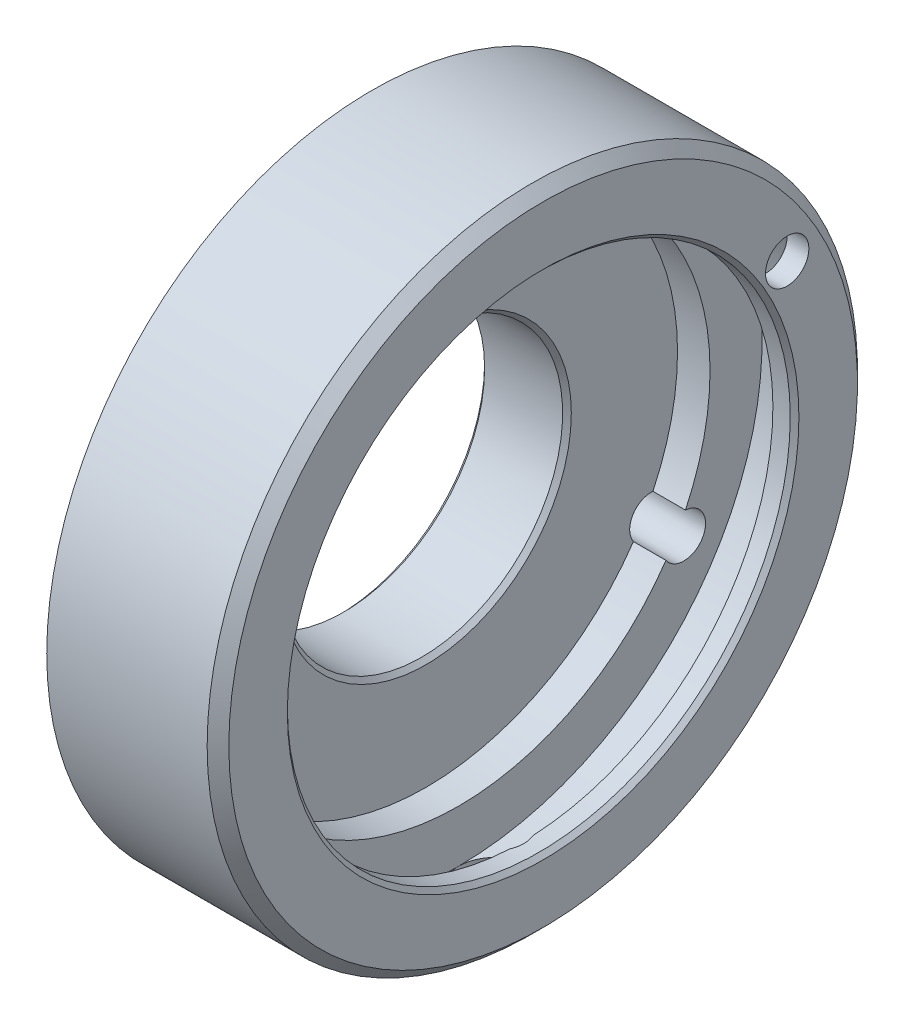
ISO-10303-21;
HEADER;
FILE_DESCRIPTION(('STEP AP214'),'2;1');
FILE_NAME('part.step','',(''),(''),'','','');
FILE_SCHEMA(('AUTOMOTIVE_DESIGN { 1 0 10303 214 1 1 1 1 }'));
ENDSEC;
DATA;
#1=APPLICATION_CONTEXT('core data for automotive mechanical design processes');
#2=APPLICATION_PROTOCOL_DEFINITION('international standard','automotive_design',2000,#1);
#3=PRODUCT_CONTEXT('',#1,'mechanical');
#4=PRODUCT('Part','Part','',(#3));
#5=PRODUCT_RELATED_PRODUCT_CATEGORY('part','',(#4));
#6=PRODUCT_DEFINITION_FORMATION('','',#4);
#7=PRODUCT_DEFINITION_CONTEXT('part definition',#1,'design');
#8=PRODUCT_DEFINITION('design','',#6,#7);
#9=PRODUCT_DEFINITION_SHAPE('','',#8);
#10=(LENGTH_UNIT() NAMED_UNIT(*) SI_UNIT(.MILLI.,.METRE.));
#11=(NAMED_UNIT(*) PLANE_ANGLE_UNIT() SI_UNIT($,.RADIAN.));
#12=(NAMED_UNIT(*) SI_UNIT($,.STERADIAN.) SOLID_ANGLE_UNIT());
#13=UNCERTAINTY_MEASURE_WITH_UNIT(LENGTH_MEASURE(1.E-05),#10,'distance_accuracy_value','');
#14=(GEOMETRIC_REPRESENTATION_CONTEXT(3) GLOBAL_UNCERTAINTY_ASSIGNED_CONTEXT((#13)) GLOBAL_UNIT_ASSIGNED_CONTEXT((#10,
#11,#12)) REPRESENTATION_CONTEXT('',''));
#15=CARTESIAN_POINT('',(0.,0.,0.));
#16=DIRECTION('',(0.,0.,1.));
#17=DIRECTION('',(1.,0.,0.));
#18=AXIS2_PLACEMENT_3D('',#15,#16,#17);
#19=CARTESIAN_POINT('',(-80.137984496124,0.,0.));
#20=DIRECTION('',(-1.,0.,0.));
#21=DIRECTION('',(0.,0.,1.));
#22=AXIS2_PLACEMENT_3D('',#19,#20,#21);
#23=CYLINDRICAL_SURFACE('',#22,11.6);
#24=CARTESIAN_POINT('',(5.50000000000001,0.,0.));
#25=DIRECTION('',(-1.,0.,0.));
#26=DIRECTION('',(0.,0.,1.));
#27=AXIS2_PLACEMENT_3D('',#24,#25,#26);
#28=CIRCLE('',#27,11.6);
#29=CARTESIAN_POINT('',(5.5,-5.00270435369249,10.4657990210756));
#30=VERTEX_POINT('',#29);
#31=CARTESIAN_POINT('',(5.5,11.565,0.90043045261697));
#32=VERTEX_POINT('',#31);
#33=EDGE_CURVE('E581',#30,#32,#28,.T.);
#34=ORIENTED_EDGE('',*,*,#33,.F.);
#35=DIRECTION('',(-1.,0.,0.));
#36=VECTOR('',#35,1.);
#37=CARTESIAN_POINT('',(4.75,-5.00270435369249,10.4657990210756));
#38=LINE('',#37,#36);
#39=CARTESIAN_POINT('',(4.,-5.00270435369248,10.4657990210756));
#40=VERTEX_POINT('',#39);
#41=EDGE_CURVE('E603',#30,#40,#38,.T.);
#42=ORIENTED_EDGE('',*,*,#41,.T.);
#43=CARTESIAN_POINT('',(4.,0.,0.));
#44=DIRECTION('',(-1.,0.,0.));
#45=DIRECTION('',(0.,0.,1.));
#46=AXIS2_PLACEMENT_3D('',#43,#44,#45);
#47=CIRCLE('',#46,11.6);
#48=CARTESIAN_POINT('',(4.,11.565,0.900430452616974));
#49=VERTEX_POINT('',#48);
#50=EDGE_CURVE('E583',#40,#49,#47,.T.);
#51=ORIENTED_EDGE('',*,*,#50,.T.);
#52=DIRECTION('',(-1.,0.,0.));
#53=VECTOR('',#52,1.);
#54=CARTESIAN_POINT('',(4.75,11.565,0.90043045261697));
#55=LINE('',#54,#53);
#56=EDGE_CURVE('E591',#49,#32,#55,.F.);
#57=ORIENTED_EDGE('',*,*,#56,.T.);
#58=EDGE_LOOP('',(#34,#42,#51,#57));
#59=FACE_BOUND('',#58,.T.);
#60=ADVANCED_FACE('F362',(#59),#23,.F.);
#61=CARTESIAN_POINT('',(4.,-6.56229564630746,-9.56536856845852));
#62=VERTEX_POINT('',#61);
#63=CARTESIAN_POINT('',(4.,-6.56229564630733,9.56536856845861));
#64=VERTEX_POINT('',#63);
#65=EDGE_CURVE('E582',#62,#64,#47,.T.);
#66=ORIENTED_EDGE('',*,*,#65,.T.);
#67=DIRECTION('',(-1.,0.,0.));
#68=VECTOR('',#67,1.);
#69=CARTESIAN_POINT('',(4.75,-6.56229564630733,9.56536856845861));
#70=LINE('',#69,#68);
#71=CARTESIAN_POINT('',(5.5,-6.56229564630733,9.56536856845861));
#72=VERTEX_POINT('',#71);
#73=EDGE_CURVE('E605',#64,#72,#70,.F.);
#74=ORIENTED_EDGE('',*,*,#73,.T.);
#75=CARTESIAN_POINT('',(5.5,-6.56229564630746,-9.56536856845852));
#76=VERTEX_POINT('',#75);
#77=EDGE_CURVE('E584',#76,#72,#28,.T.);
#78=ORIENTED_EDGE('',*,*,#77,.F.);
#79=DIRECTION('',(-1.,0.,0.));
#80=VECTOR('',#79,1.);
#81=CARTESIAN_POINT('',(4.75,-6.56229564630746,-9.56536856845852));
#82=LINE('',#81,#80);
#83=EDGE_CURVE('E597',#76,#62,#82,.T.);
#84=ORIENTED_EDGE('',*,*,#83,.T.);
#85=EDGE_LOOP('',(#66,#74,#78,#84));
#86=FACE_BOUND('',#85,.T.);
#87=ADVANCED_FACE('F549',(#86),#23,.F.);
#88=CARTESIAN_POINT('',(0.,6.5,0.));
#89=DIRECTION('',(1.,0.,0.));
#90=DIRECTION('',(0.,0.,-1.));
#91=AXIS2_PLACEMENT_3D('',#88,#89,#90);
#92=PLANE('',#91);
#93=CARTESIAN_POINT('',(0.,0.,0.));
#94=DIRECTION('',(1.,0.,0.));
#95=DIRECTION('',(0.,0.,-1.));
#96=AXIS2_PLACEMENT_3D('',#93,#94,#95);
#97=CIRCLE('',#96,6.7);
#98=CARTESIAN_POINT('',(0.,0.,-6.7));
#99=VERTEX_POINT('',#98);
#100=EDGE_CURVE('E499',#99,#99,#97,.T.);
#101=ORIENTED_EDGE('',*,*,#100,.T.);
#102=EDGE_LOOP('',(#101));
#103=FACE_BOUND('',#102,.T.);
#104=CARTESIAN_POINT('',(0.,0.,0.));
#105=DIRECTION('',(1.,0.,0.));
#106=DIRECTION('',(0.,0.,-1.));
#107=AXIS2_PLACEMENT_3D('',#104,#105,#106);
#108=CIRCLE('',#107,8.8);
#109=CARTESIAN_POINT('',(0.,0.,-8.8));
#110=VERTEX_POINT('',#109);
#111=EDGE_CURVE('E496',#110,#110,#108,.F.);
#112=ORIENTED_EDGE('',*,*,#111,.T.);
#113=EDGE_LOOP('',(#112));
#114=FACE_BOUND('',#113,.T.);
#115=ADVANCED_FACE('F364',(#103,#114),#92,.F.);
#116=CARTESIAN_POINT('',(-80.137984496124,0.,0.));
#117=DIRECTION('',(-1.,0.,0.));
#118=DIRECTION('',(0.,0.,1.));
#119=AXIS2_PLACEMENT_3D('',#116,#117,#118);
#120=CYLINDRICAL_SURFACE('',#119,9.);
#121=CARTESIAN_POINT('',(0.200000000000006,0.,0.));
#122=DIRECTION('',(1.,0.,0.));
#123=DIRECTION('',(0.,0.,-1.));
#124=AXIS2_PLACEMENT_3D('',#121,#122,#123);
#125=CIRCLE('',#124,9.);
#126=CARTESIAN_POINT('',(0.200000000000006,0.,-9.));
#127=VERTEX_POINT('',#126);
#128=EDGE_CURVE('E502',#127,#127,#125,.T.);
#129=ORIENTED_EDGE('',*,*,#128,.T.);
#130=EDGE_LOOP('',(#129));
#131=FACE_BOUND('',#130,.T.);
#132=CARTESIAN_POINT('',(1.5,0.,0.));
#133=DIRECTION('',(-1.,0.,0.));
#134=DIRECTION('',(0.,0.,1.));
#135=AXIS2_PLACEMENT_3D('',#132,#133,#134);
#136=CIRCLE('',#135,9.);
#137=CARTESIAN_POINT('',(1.5,0.,9.));
#138=VERTEX_POINT('',#137);
#139=EDGE_CURVE('E472',#138,#138,#136,.T.);
#140=ORIENTED_EDGE('',*,*,#139,.T.);
#141=EDGE_LOOP('',(#140));
#142=FACE_BOUND('',#141,.T.);
#143=ADVANCED_FACE('F674',(#131,#142),#120,.T.);
#144=CARTESIAN_POINT('',(1.5,9.,0.));
#145=DIRECTION('',(1.,0.,0.));
#146=DIRECTION('',(0.,0.,-1.));
#147=AXIS2_PLACEMENT_3D('',#144,#145,#146);
#148=PLANE('',#147);
#149=CARTESIAN_POINT('',(1.5,-5.9999999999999,10.3923048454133));
#150=DIRECTION('',(1.,0.,0.));
#151=DIRECTION('',(0.,0.,-1.));
#152=AXIS2_PLACEMENT_3D('',#149,#150,#151);
#153=CIRCLE('',#152,1.1);
#154=CARTESIAN_POINT('',(1.5,-5.9999999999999,9.29230484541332));
#155=VERTEX_POINT('',#154);
#156=EDGE_CURVE('E523',#155,#155,#153,.T.);
#157=ORIENTED_EDGE('',*,*,#156,.T.);
#158=EDGE_LOOP('',(#157));
#159=FACE_BOUND('',#158,.T.);
#160=CARTESIAN_POINT('',(1.5,12.,0.));
#161=DIRECTION('',(1.,0.,0.));
#162=DIRECTION('',(0.,0.,-1.));
#163=AXIS2_PLACEMENT_3D('',#160,#161,#162);
#164=CIRCLE('',#163,1.1);
#165=CARTESIAN_POINT('',(1.5,12.,-1.1));
#166=VERTEX_POINT('',#165);
#167=EDGE_CURVE('E520',#166,#166,#164,.T.);
#168=ORIENTED_EDGE('',*,*,#167,.T.);
#169=EDGE_LOOP('',(#168));
#170=FACE_BOUND('',#169,.T.);
#171=CARTESIAN_POINT('',(1.5,-6.00000000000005,-10.3923048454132));
#172=DIRECTION('',(1.,0.,0.));
#173=DIRECTION('',(0.,0.,-1.));
#174=AXIS2_PLACEMENT_3D('',#171,#172,#173);
#175=CIRCLE('',#174,1.1);
#176=CARTESIAN_POINT('',(1.5,-6.00000000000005,-11.4923048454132));
#177=VERTEX_POINT('',#176);
#178=EDGE_CURVE('E517',#177,#177,#175,.T.);
#179=ORIENTED_EDGE('',*,*,#178,.T.);
#180=EDGE_LOOP('',(#179));
#181=FACE_BOUND('',#180,.T.);
#182=ORIENTED_EDGE('',*,*,#139,.F.);
#183=EDGE_LOOP('',(#182));
#184=FACE_BOUND('',#183,.T.);
#185=CARTESIAN_POINT('',(1.5,0.,0.));
#186=DIRECTION('',(-1.,0.,0.));
#187=DIRECTION('',(0.,0.,1.));
#188=AXIS2_PLACEMENT_3D('',#185,#186,#187);
#189=CIRCLE('',#188,15.);
#190=CARTESIAN_POINT('',(1.5,0.,15.));
#191=VERTEX_POINT('',#190);
#192=EDGE_CURVE('E469',#191,#191,#189,.T.);
#193=ORIENTED_EDGE('',*,*,#192,.T.);
#194=EDGE_LOOP('',(#193));
#195=FACE_BOUND('',#194,.T.);
#196=ADVANCED_FACE('F653',(#159,#170,#181,#184,#195),#148,.F.);
#197=CARTESIAN_POINT('',(-80.137984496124,0.,0.));
#198=DIRECTION('',(-1.,0.,0.));
#199=DIRECTION('',(0.,0.,1.));
#200=AXIS2_PLACEMENT_3D('',#197,#198,#199);
#201=CYLINDRICAL_SURFACE('',#200,15.);
#202=CARTESIAN_POINT('',(5.5,-15.,0.));
#203=CARTESIAN_POINT('',(5.50000363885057,-14.9999990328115,0.0840305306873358));
#204=CARTESIAN_POINT('',(5.50708490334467,-14.9992863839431,0.168116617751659));
#205=CARTESIAN_POINT('',(5.53522655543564,-14.9965120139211,0.333957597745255));
#206=CARTESIAN_POINT('',(5.55630234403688,-14.9944488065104,0.415709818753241));
#207=CARTESIAN_POINT('',(5.61181336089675,-14.9892062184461,0.574457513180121));
#208=CARTESIAN_POINT('',(5.64624052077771,-14.9860275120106,0.651455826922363));
#209=CARTESIAN_POINT('',(5.72746136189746,-14.9789093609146,0.798564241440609));
#210=CARTESIAN_POINT('',(5.77425258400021,-14.974970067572,0.868675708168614));
#211=CARTESIAN_POINT('',(5.87905404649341,-14.9667561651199,1.00028932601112));
#212=CARTESIAN_POINT('',(5.93709969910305,-14.962480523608,1.06176321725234));
#213=CARTESIAN_POINT('',(6.06268680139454,-14.9540843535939,1.17411378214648));
#214=CARTESIAN_POINT('',(6.13022869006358,-14.9499638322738,1.22498996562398));
#215=CARTESIAN_POINT('',(6.27306779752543,-14.9423338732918,1.31480095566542));
#216=CARTESIAN_POINT('',(6.34838116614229,-14.9388257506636,1.35371019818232));
#217=CARTESIAN_POINT('',(6.50451337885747,-14.9328305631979,1.41831957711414));
#218=CARTESIAN_POINT('',(6.58533208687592,-14.9303434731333,1.44402003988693));
#219=CARTESIAN_POINT('',(6.74989270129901,-14.9266812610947,1.48139856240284));
#220=CARTESIAN_POINT('',(6.83362386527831,-14.9255017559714,1.49312347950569));
#221=CARTESIAN_POINT('',(7.00187329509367,-14.9245746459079,1.50236292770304));
#222=CARTESIAN_POINT('',(7.08639154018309,-14.9248270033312,1.4998778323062));
#223=CARTESIAN_POINT('',(7.25349296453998,-14.926731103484,1.48080642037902));
#224=CARTESIAN_POINT('',(7.33608204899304,-14.9283777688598,1.46427126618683));
#225=CARTESIAN_POINT('',(7.49730694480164,-14.9328770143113,1.41764871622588));
#226=CARTESIAN_POINT('',(7.57594270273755,-14.9357296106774,1.38756113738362));
#227=CARTESIAN_POINT('',(7.72719038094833,-14.9423251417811,1.31463134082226));
#228=CARTESIAN_POINT('',(7.79979128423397,-14.9460696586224,1.27176642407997));
#229=CARTESIAN_POINT('',(7.93678782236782,-14.9540257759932,1.17451504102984));
#230=CARTESIAN_POINT('',(8.00118321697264,-14.9582373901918,1.12012823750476));
#231=CARTESIAN_POINT('',(8.12023809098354,-14.9666757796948,1.0010911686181));
#232=CARTESIAN_POINT('',(8.1748534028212,-14.970902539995,0.936396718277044));
#233=CARTESIAN_POINT('',(8.27245544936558,-14.9788774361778,0.798734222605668));
#234=CARTESIAN_POINT('',(8.31544217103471,-14.9826255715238,0.7257661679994));
#235=CARTESIAN_POINT('',(8.38856503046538,-14.9892221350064,0.573597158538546));
#236=CARTESIAN_POINT('',(8.41869892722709,-14.9920704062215,0.494395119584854));
#237=CARTESIAN_POINT('',(8.46522837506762,-14.9965447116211,0.332020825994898));
#238=CARTESIAN_POINT('',(8.48162433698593,-14.9981707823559,0.2488486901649));
#239=CARTESIAN_POINT('',(8.50015646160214,-15.0000127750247,0.0812776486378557));
#240=CARTESIAN_POINT('',(8.50235357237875,-15.000234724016,-0.00311445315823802));
#241=CARTESIAN_POINT('',(8.49258570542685,-14.999259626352,-0.17106568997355));
#242=CARTESIAN_POINT('',(8.48062091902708,-14.998062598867,-0.254624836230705));
#243=CARTESIAN_POINT('',(8.44291945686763,-14.9943879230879,-0.418362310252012));
#244=CARTESIAN_POINT('',(8.41721131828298,-14.9919129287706,-0.498547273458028));
#245=CARTESIAN_POINT('',(8.35278223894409,-14.9859599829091,-0.653466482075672));
#246=CARTESIAN_POINT('',(8.3140610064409,-14.9824820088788,-0.728200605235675));
#247=CARTESIAN_POINT('',(8.22455374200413,-14.9748971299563,-0.870372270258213));
#248=CARTESIAN_POINT('',(8.17372766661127,-14.9707881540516,-0.937784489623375));
#249=CARTESIAN_POINT('',(8.06151089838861,-14.9624089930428,-1.06314243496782));
#250=CARTESIAN_POINT('',(8.00011994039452,-14.9581388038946,-1.12108792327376));
#251=CARTESIAN_POINT('',(7.86825013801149,-14.9499003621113,-1.22607916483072));
#252=CARTESIAN_POINT('',(7.79773936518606,-14.9459332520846,-1.27308491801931));
#253=CARTESIAN_POINT('',(7.64978895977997,-14.9387674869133,-1.35458738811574));
#254=CARTESIAN_POINT('',(7.5723494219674,-14.9355688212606,-1.38908427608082));
#255=CARTESIAN_POINT('',(7.41287689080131,-14.9303092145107,-1.44452281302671));
#256=CARTESIAN_POINT('',(7.33085223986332,-14.9282462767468,-1.46548826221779));
#257=CARTESIAN_POINT('',(7.16442520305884,-14.9254854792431,-1.49334601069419));
#258=CARTESIAN_POINT('',(7.08002288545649,-14.9247875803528,-1.50023871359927));
#259=CARTESIAN_POINT('',(6.91163396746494,-14.9248366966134,-1.49974970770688));
#260=CARTESIAN_POINT('',(6.82764717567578,-14.9255773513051,-1.49243083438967));
#261=CARTESIAN_POINT('',(6.66210262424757,-14.9284065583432,-1.46385817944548));
#262=CARTESIAN_POINT('',(6.58054486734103,-14.9304951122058,-1.44260438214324));
#263=CARTESIAN_POINT('',(6.42217397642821,-14.9357830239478,-1.38678252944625));
#264=CARTESIAN_POINT('',(6.34536018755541,-14.9389822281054,-1.35221631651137));
#265=CARTESIAN_POINT('',(6.19861466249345,-14.9461312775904,-1.27075733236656));
#266=CARTESIAN_POINT('',(6.12868288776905,-14.9500811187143,-1.22386463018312));
#267=CARTESIAN_POINT('',(5.99736448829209,-14.9583073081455,-1.118847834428));
#268=CARTESIAN_POINT('',(5.93601538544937,-14.9625849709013,-1.0606769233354));
#269=CARTESIAN_POINT('',(5.82392165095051,-14.9709728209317,-0.934847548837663));
#270=CARTESIAN_POINT('',(5.77317956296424,-14.9750829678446,-0.867186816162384));
#271=CARTESIAN_POINT('',(5.68363981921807,-14.9826834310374,-0.724112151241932));
#272=CARTESIAN_POINT('',(5.64487256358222,-14.9861721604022,-0.648679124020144));
#273=CARTESIAN_POINT('',(5.5806063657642,-14.9921194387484,-0.492387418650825));
#274=CARTESIAN_POINT('',(5.55509246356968,-14.9945791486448,-0.411534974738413));
#275=CARTESIAN_POINT('',(5.5244190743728,-14.997573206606,-0.275187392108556));
#276=CARTESIAN_POINT('',(5.51527443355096,-14.9984790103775,-0.220563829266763));
#277=CARTESIAN_POINT('',(5.50306371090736,-14.9996927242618,-0.11063487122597));
#278=CARTESIAN_POINT('',(5.49999760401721,-15.0000006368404,-0.055329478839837));
#279=CARTESIAN_POINT('',(5.5,-15.,0.));
#280=B_SPLINE_CURVE_WITH_KNOTS('',3,(#202,#203,#204,#205,#206,#207,#208,#209,#210,#211,#212,
#213,#214,#215,#216,#217,#218,#219,#220,#221,#222,#223,#224,#225,#226,#227,#228,#229,#230,#231,
#232,#233,#234,#235,#236,#237,#238,#239,#240,#241,#242,#243,#244,#245,#246,#247,#248,#249,#250,
#251,#252,#253,#254,#255,#256,#257,#258,#259,#260,#261,#262,#263,#264,#265,#266,#267,#268,#269,
#270,#271,#272,#273,#274,#275,#276,#277,#278,#279),.UNSPECIFIED.,.T.,.F.,(4,2,2,2,2,2,2,2,2,2,2,
2,2,2,2,2,2,2,2,2,2,2,2,2,2,2,2,2,2,2,2,2,2,2,2,2,2,2,4),(0.,0.25188954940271,0.504056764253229,
0.756071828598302,1.00803680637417,1.26080785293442,1.51359058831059,1.76690963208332,
2.02022241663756,2.27268348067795,2.52513790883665,2.77667696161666,3.0282194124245,
3.28021142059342,3.53221080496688,3.78532101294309,4.03843150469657,4.29158611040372,
4.54473314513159,4.79679282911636,5.04884910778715,5.30038402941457,5.551924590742,
5.80430911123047,6.05669996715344,6.30999965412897,6.5632958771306,6.81614535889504,
7.06898758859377,7.32071443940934,7.57244157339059,7.82413388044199,8.07582477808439,
8.32858376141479,8.58140328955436,8.83485946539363,9.08802892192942,9.25388500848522,
9.4197404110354),.UNSPECIFIED.);
#281=CARTESIAN_POINT('',(5.5,-15.,0.));
#282=VERTEX_POINT('',#281);
#283=EDGE_CURVE('E458',#282,#282,#280,.T.);
#284=ORIENTED_EDGE('',*,*,#283,.T.);
#285=EDGE_LOOP('',(#284));
#286=FACE_BOUND('',#285,.T.);
#287=CARTESIAN_POINT('',(8.90000000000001,0.,0.));
#288=DIRECTION('',(-1.,0.,0.));
#289=DIRECTION('',(0.,0.,1.));
#290=AXIS2_PLACEMENT_3D('',#287,#288,#289);
#291=CIRCLE('',#290,15.);
#292=CARTESIAN_POINT('',(8.90000000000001,0.,15.));
#293=VERTEX_POINT('',#292);
#294=EDGE_CURVE('E475',#293,#293,#291,.T.);
#295=ORIENTED_EDGE('',*,*,#294,.T.);
#296=EDGE_LOOP('',(#295));
#297=FACE_BOUND('',#296,.T.);
#298=ORIENTED_EDGE('',*,*,#192,.F.);
#299=EDGE_LOOP('',(#298));
#300=FACE_BOUND('',#299,.T.);
#301=ADVANCED_FACE('F618',(#286,#297,#300),#201,.T.);
#302=CARTESIAN_POINT('',(9.4,15.,0.));
#303=DIRECTION('',(-1.,0.,0.));
#304=DIRECTION('',(0.,0.,1.));
#305=AXIS2_PLACEMENT_3D('',#302,#303,#304);
#306=PLANE('',#305);
#307=CARTESIAN_POINT('',(9.4,6.4999999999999,-11.2583302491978));
#308=DIRECTION('',(1.,0.,0.));
#309=DIRECTION('',(0.,0.,-1.));
#310=AXIS2_PLACEMENT_3D('',#307,#308,#309);
#311=CIRCLE('',#310,0.999999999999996);
#312=CARTESIAN_POINT('',(9.4,6.4999999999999,-12.2583302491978));
#313=VERTEX_POINT('',#312);
#314=EDGE_CURVE('E658',#313,#313,#311,.T.);
#315=ORIENTED_EDGE('',*,*,#314,.F.);
#316=EDGE_LOOP('',(#315));
#317=FACE_BOUND('',#316,.T.);
#318=CARTESIAN_POINT('',(9.4,0.,0.));
#319=DIRECTION('',(-1.,0.,0.));
#320=DIRECTION('',(0.,0.,1.));
#321=AXIS2_PLACEMENT_3D('',#318,#319,#320);
#322=CIRCLE('',#321,11.8);
#323=CARTESIAN_POINT('',(9.4,0.,11.8));
#324=VERTEX_POINT('',#323);
#325=EDGE_CURVE('E481',#324,#324,#322,.T.);
#326=ORIENTED_EDGE('',*,*,#325,.T.);
#327=EDGE_LOOP('',(#326));
#328=FACE_BOUND('',#327,.T.);
#329=CARTESIAN_POINT('',(9.4,0.,0.));
#330=DIRECTION('',(-1.,0.,0.));
#331=DIRECTION('',(0.,0.,1.));
#332=AXIS2_PLACEMENT_3D('',#329,#330,#331);
#333=CIRCLE('',#332,14.5);
#334=CARTESIAN_POINT('',(9.4,0.,14.5));
#335=VERTEX_POINT('',#334);
#336=EDGE_CURVE('E478',#335,#335,#333,.F.);
#337=ORIENTED_EDGE('',*,*,#336,.T.);
#338=EDGE_LOOP('',(#337));
#339=FACE_BOUND('',#338,.T.);
#340=ADVANCED_FACE('F645',(#317,#328,#339),#306,.F.);
#341=CARTESIAN_POINT('',(-80.137984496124,0.,0.));
#342=DIRECTION('',(-1.,0.,0.));
#343=DIRECTION('',(0.,0.,1.));
#344=AXIS2_PLACEMENT_3D('',#341,#342,#343);
#345=CYLINDRICAL_SURFACE('',#344,11.6);
#346=CARTESIAN_POINT('',(9.2,0.,0.));
#347=DIRECTION('',(-1.,0.,0.));
#348=DIRECTION('',(0.,0.,1.));
#349=AXIS2_PLACEMENT_3D('',#346,#347,#348);
#350=CIRCLE('',#349,11.6);
#351=CARTESIAN_POINT('',(9.2,0.,11.6));
#352=VERTEX_POINT('',#351);
#353=EDGE_CURVE('E484',#352,#352,#350,.F.);
#354=ORIENTED_EDGE('',*,*,#353,.T.);
#355=EDGE_LOOP('',(#354));
#356=FACE_BOUND('',#355,.T.);
#357=CARTESIAN_POINT('',(8.4,0.,0.));
#358=DIRECTION('',(-1.,0.,0.));
#359=DIRECTION('',(0.,0.,1.));
#360=AXIS2_PLACEMENT_3D('',#357,#358,#359);
#361=CIRCLE('',#360,11.6);
#362=CARTESIAN_POINT('',(8.4,-11.587493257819,0.538516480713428));
#363=VERTEX_POINT('',#362);
#364=CARTESIAN_POINT('',(8.4,-11.587493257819,-0.538516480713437));
#365=VERTEX_POINT('',#364);
#366=EDGE_CURVE('E466',#363,#365,#361,.T.);
#367=ORIENTED_EDGE('',*,*,#366,.T.);
#368=CARTESIAN_POINT('',(7.,-11.502608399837,1.5));
#369=CARTESIAN_POINT('',(6.91612311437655,-11.5026096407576,1.49999644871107));
#370=CARTESIAN_POINT('',(6.83219439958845,-11.5035357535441,1.49294092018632));
#371=CARTESIAN_POINT('',(6.66667444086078,-11.5071385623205,1.46490755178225));
#372=CARTESIAN_POINT('',(6.58508570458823,-11.5098170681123,1.44391531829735));
#373=CARTESIAN_POINT('',(6.42666602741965,-11.516616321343,1.38863924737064));
#374=CARTESIAN_POINT('',(6.3498318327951,-11.5207360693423,1.35436461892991));
#375=CARTESIAN_POINT('',(6.20301939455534,-11.5299524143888,1.2735167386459));
#376=CARTESIAN_POINT('',(6.13304001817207,-11.5350488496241,1.22694552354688));
#377=CARTESIAN_POINT('',(6.00149142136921,-11.5456784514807,1.12252829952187));
#378=CARTESIAN_POINT('',(5.93996912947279,-11.5512138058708,1.06462338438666));
#379=CARTESIAN_POINT('',(5.82748667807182,-11.5620779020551,0.93930935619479));
#380=CARTESIAN_POINT('',(5.77652705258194,-11.5674066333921,0.87189976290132));
#381=CARTESIAN_POINT('',(5.68644730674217,-11.577279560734,0.729193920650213));
#382=CARTESIAN_POINT('',(5.64736978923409,-11.5818209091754,0.653870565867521));
#383=CARTESIAN_POINT('',(5.58243648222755,-11.5895833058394,0.497661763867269));
#384=CARTESIAN_POINT('',(5.5565801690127,-11.5928044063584,0.416776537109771));
#385=CARTESIAN_POINT('',(5.51896381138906,-11.5975479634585,0.252220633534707));
#386=CARTESIAN_POINT('',(5.50712563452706,-11.599079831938,0.168568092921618));
#387=CARTESIAN_POINT('',(5.49763937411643,-11.6003044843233,0.000450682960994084));
#388=CARTESIAN_POINT('',(5.49999069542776,-11.5999973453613,-0.0840141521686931));
#389=CARTESIAN_POINT('',(5.5187542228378,-11.5975861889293,-0.250826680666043));
#390=CARTESIAN_POINT('',(5.53508239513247,-11.5954929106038,-0.333184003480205));
#391=CARTESIAN_POINT('',(5.58120467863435,-11.5897567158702,-0.493979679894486));
#392=CARTESIAN_POINT('',(5.61099906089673,-11.5861137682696,-0.572417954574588));
#393=CARTESIAN_POINT('',(5.68329683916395,-11.5776690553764,-0.723408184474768));
#394=CARTESIAN_POINT('',(5.72583644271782,-11.5728639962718,-0.795942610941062));
#395=CARTESIAN_POINT('',(5.82239076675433,-11.5626323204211,-0.93287495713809));
#396=CARTESIAN_POINT('',(5.8764060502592,-11.5572056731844,-0.997272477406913));
#397=CARTESIAN_POINT('',(5.99484870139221,-11.546290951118,-1.11659696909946));
#398=CARTESIAN_POINT('',(6.0593493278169,-11.5408027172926,-1.17145123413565));
#399=CARTESIAN_POINT('',(6.19668051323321,-11.5304224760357,-1.26956660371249));
#400=CARTESIAN_POINT('',(6.26951110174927,-11.5255304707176,-1.31282766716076));
#401=CARTESIAN_POINT('',(6.42150135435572,-11.5168966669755,-1.38653366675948));
#402=CARTESIAN_POINT('',(6.50066400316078,-11.5131554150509,-1.41697251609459));
#403=CARTESIAN_POINT('',(6.66303639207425,-11.5072572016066,-1.46410418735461));
#404=CARTESIAN_POINT('',(6.74624592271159,-11.5051001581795,-1.480797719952));
#405=CARTESIAN_POINT('',(6.91370716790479,-11.5026296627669,-1.49986805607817));
#406=CARTESIAN_POINT('',(6.99794702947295,-11.5023030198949,-1.50234729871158));
#407=CARTESIAN_POINT('',(7.1656409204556,-11.5034954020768,-1.49318921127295));
#408=CARTESIAN_POINT('',(7.24909496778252,-11.5050143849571,-1.4815522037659));
#409=CARTESIAN_POINT('',(7.41253963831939,-11.5097148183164,-1.44457830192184));
#410=CARTESIAN_POINT('',(7.49254172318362,-11.5128902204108,-1.41929123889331));
#411=CARTESIAN_POINT('',(7.64717052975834,-11.5205407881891,-1.35578641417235));
#412=CARTESIAN_POINT('',(7.72179704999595,-11.5250160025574,-1.31756816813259));
#413=CARTESIAN_POINT('',(7.86401914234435,-11.534793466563,-1.2290349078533));
#414=CARTESIAN_POINT('',(7.93157266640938,-11.5401002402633,-1.17865285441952));
#415=CARTESIAN_POINT('',(8.05730162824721,-11.5509287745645,-1.06731665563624));
#416=CARTESIAN_POINT('',(8.11547667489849,-11.5564505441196,-1.00636206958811));
#417=CARTESIAN_POINT('',(8.22115844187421,-11.5671275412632,-0.875163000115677));
#418=CARTESIAN_POINT('',(8.26859775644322,-11.5722803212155,-0.804863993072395));
#419=CARTESIAN_POINT('',(8.35099451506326,-11.5816019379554,-0.657235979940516));
#420=CARTESIAN_POINT('',(8.38595222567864,-11.5857707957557,-0.5799071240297));
#421=CARTESIAN_POINT('',(8.44228271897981,-11.5926440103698,-0.420636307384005));
#422=CARTESIAN_POINT('',(8.46369411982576,-11.5953525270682,-0.338708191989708));
#423=CARTESIAN_POINT('',(8.49244973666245,-11.5990171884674,-0.172382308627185));
#424=CARTESIAN_POINT('',(8.49979463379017,-11.5999734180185,-0.0879846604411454));
#425=CARTESIAN_POINT('',(8.50019539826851,-11.6000252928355,0.0802271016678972));
#426=CARTESIAN_POINT('',(8.49335507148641,-11.5991344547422,0.16404098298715));
#427=CARTESIAN_POINT('',(8.46579983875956,-11.5956192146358,0.329317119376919));
#428=CARTESIAN_POINT('',(8.44508494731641,-11.5929948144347,0.410779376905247));
#429=CARTESIAN_POINT('',(8.39040190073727,-11.5863059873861,0.569023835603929));
#430=CARTESIAN_POINT('',(8.35643907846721,-11.5822421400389,0.645807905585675));
#431=CARTESIAN_POINT('',(8.27623502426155,-11.5731238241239,0.792603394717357));
#432=CARTESIAN_POINT('',(8.22999360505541,-11.5680693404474,0.862614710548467));
#433=CARTESIAN_POINT('',(8.12616221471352,-11.5574894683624,0.994407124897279));
#434=CARTESIAN_POINT('',(8.06849507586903,-11.551961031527,1.05612718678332));
#435=CARTESIAN_POINT('',(7.94361010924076,-11.5410805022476,1.16905431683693));
#436=CARTESIAN_POINT('',(7.87639002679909,-11.5357284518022,1.22025889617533));
#437=CARTESIAN_POINT('',(7.73398711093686,-11.525783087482,1.310884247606));
#438=CARTESIAN_POINT('',(7.65877252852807,-11.5211929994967,1.35025546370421));
#439=CARTESIAN_POINT('',(7.5027807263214,-11.5133290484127,1.41575141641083));
#440=CARTESIAN_POINT('',(7.42200962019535,-11.5100537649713,1.44189045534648));
#441=CARTESIAN_POINT('',(7.28402402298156,-11.5059794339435,1.47397366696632));
#442=CARTESIAN_POINT('',(7.22767725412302,-11.504721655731,1.48371936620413));
#443=CARTESIAN_POINT('',(7.11422833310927,-11.5030357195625,1.49673371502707));
#444=CARTESIAN_POINT('',(7.05712618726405,-11.5026075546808,1.50000241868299));
#445=CARTESIAN_POINT('',(7.,-11.502608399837,1.5));
#446=B_SPLINE_CURVE_WITH_KNOTS('',3,(#368,#369,#370,#371,#372,#373,#374,#375,#376,#377,#378,
#379,#380,#381,#382,#383,#384,#385,#386,#387,#388,#389,#390,#391,#392,#393,#394,#395,#396,#397,
#398,#399,#400,#401,#402,#403,#404,#405,#406,#407,#408,#409,#410,#411,#412,#413,#414,#415,#416,
#417,#418,#419,#420,#421,#422,#423,#424,#425,#426,#427,#428,#429,#430,#431,#432,#433,#434,#435,
#436,#437,#438,#439,#440,#441,#442,#443,#444,#445),.UNSPECIFIED.,.T.,.F.,(4,2,2,2,2,2,2,2,2,2,2,
2,2,2,2,2,2,2,2,2,2,2,2,2,2,2,2,2,2,2,2,2,2,2,2,2,2,2,4),(0.,0.251421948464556,
0.503103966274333,0.754611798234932,1.00607799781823,1.25888765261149,1.51171008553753,
1.76542859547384,2.01913705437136,2.27142466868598,2.52370170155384,2.77447252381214,
3.02524839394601,3.27674355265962,3.5282510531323,3.78159793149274,4.03494570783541,
4.28841361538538,4.54186841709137,4.79349431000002,5.0451144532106,5.29582217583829,
5.54653928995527,5.79867107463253,6.05081337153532,6.30449737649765,6.5581759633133,
6.81112805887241,7.06406790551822,7.31516330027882,7.56625843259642,7.81725259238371,
8.06825058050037,8.32100540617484,8.57381998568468,8.82767900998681,9.08126305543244,
9.25250090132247,9.42373731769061),.UNSPECIFIED.);
#447=EDGE_CURVE('E635',#365,#363,#446,.T.);
#448=ORIENTED_EDGE('',*,*,#447,.T.);
#449=EDGE_LOOP('',(#367,#448));
#450=FACE_BOUND('',#449,.T.);
#451=ADVANCED_FACE('F640',(#356,#450),#345,.F.);
#452=CARTESIAN_POINT('',(8.4,11.6,0.));
#453=DIRECTION('',(1.,0.,0.));
#454=DIRECTION('',(0.,0.,-1.));
#455=AXIS2_PLACEMENT_3D('',#452,#453,#454);
#456=PLANE('',#455);
#457=CARTESIAN_POINT('',(8.4,0.,0.));
#458=DIRECTION('',(-1.,0.,0.));
#459=DIRECTION('',(0.,0.,1.));
#460=AXIS2_PLACEMENT_3D('',#457,#458,#459);
#461=CIRCLE('',#460,14.);
#462=CARTESIAN_POINT('',(8.4,-13.98963902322,0.538516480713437));
#463=VERTEX_POINT('',#462);
#464=CARTESIAN_POINT('',(8.4,6.99999999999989,-12.1243556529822));
#465=VERTEX_POINT('',#464);
#466=EDGE_CURVE('E457',#463,#465,#461,.T.);
#467=ORIENTED_EDGE('',*,*,#466,.T.);
#468=CARTESIAN_POINT('',(8.4,6.4999999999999,-11.2583302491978));
#469=DIRECTION('',(1.,0.,0.));
#470=DIRECTION('',(0.,0.,-1.));
#471=AXIS2_PLACEMENT_3D('',#468,#469,#470);
#472=CIRCLE('',#471,0.999999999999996);
#473=EDGE_CURVE('E376',#465,#465,#472,.T.);
#474=ORIENTED_EDGE('',*,*,#473,.T.);
#475=CARTESIAN_POINT('',(8.4,-13.98963902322,-0.538516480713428));
#476=VERTEX_POINT('',#475);
#477=EDGE_CURVE('E461',#465,#476,#461,.T.);
#478=ORIENTED_EDGE('',*,*,#477,.T.);
#479=DIRECTION('',(0.,1.,0.));
#480=VECTOR('',#479,1.);
#481=CARTESIAN_POINT('',(8.4,-15.,-0.538516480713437));
#482=LINE('',#481,#480);
#483=EDGE_CURVE('E453',#476,#365,#482,.T.);
#484=ORIENTED_EDGE('',*,*,#483,.T.);
#485=ORIENTED_EDGE('',*,*,#366,.F.);
#486=DIRECTION('',(0.,1.,0.));
#487=VECTOR('',#486,1.);
#488=CARTESIAN_POINT('',(8.4,-15.,0.538516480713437));
#489=LINE('',#488,#487);
#490=EDGE_CURVE('E459',#363,#463,#489,.F.);
#491=ORIENTED_EDGE('',*,*,#490,.T.);
#492=EDGE_LOOP('',(#467,#474,#478,#484,#485,#491));
#493=FACE_BOUND('',#492,.T.);
#494=ADVANCED_FACE('F644',(#493),#456,.F.);
#495=CARTESIAN_POINT('',(-80.137984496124,0.,0.));
#496=DIRECTION('',(-1.,0.,0.));
#497=DIRECTION('',(0.,0.,1.));
#498=AXIS2_PLACEMENT_3D('',#495,#496,#497);
#499=CYLINDRICAL_SURFACE('',#498,14.);
#500=CARTESIAN_POINT('',(5.50000000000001,0.,0.));
#501=DIRECTION('',(-1.,0.,0.));
#502=DIRECTION('',(0.,0.,1.));
#503=AXIS2_PLACEMENT_3D('',#500,#501,#502);
#504=CIRCLE('',#503,14.);
#505=CARTESIAN_POINT('',(5.50000000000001,-14.,0.));
#506=VERTEX_POINT('',#505);
#507=CARTESIAN_POINT('',(5.5,6.99999999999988,-12.1243556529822));
#508=VERTEX_POINT('',#507);
#509=EDGE_CURVE('E442',#506,#508,#504,.T.);
#510=ORIENTED_EDGE('',*,*,#509,.T.);
#511=EDGE_CURVE('E435',#508,#506,#504,.T.);
#512=ORIENTED_EDGE('',*,*,#511,.T.);
#513=CARTESIAN_POINT('',(8.4,-13.98963902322,0.538516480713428));
#514=CARTESIAN_POINT('',(8.38483376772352,-13.9881220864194,0.577943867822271));
#515=CARTESIAN_POINT('',(8.36801075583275,-13.9864621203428,0.616706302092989));
#516=CARTESIAN_POINT('',(8.33116468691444,-13.982905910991,0.692664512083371));
#517=CARTESIAN_POINT('',(8.31114185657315,-13.9810096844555,0.729860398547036));
#518=CARTESIAN_POINT('',(8.24651007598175,-13.9750473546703,0.838633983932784));
#519=CARTESIAN_POINT('',(8.19728802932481,-13.9707023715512,0.907526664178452));
#520=CARTESIAN_POINT('',(8.08799288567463,-13.9617609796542,1.03605023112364));
#521=CARTESIAN_POINT('',(8.02791577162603,-13.9571644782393,1.09567767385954));
#522=CARTESIAN_POINT('',(7.8985952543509,-13.9482372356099,1.20400823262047));
#523=CARTESIAN_POINT('',(7.82935339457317,-13.9439064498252,1.25271318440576));
#524=CARTESIAN_POINT('',(7.68356515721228,-13.9359953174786,1.33786155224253));
#525=CARTESIAN_POINT('',(7.60701118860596,-13.9324157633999,1.37429204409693));
#526=CARTESIAN_POINT('',(7.44881485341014,-13.9264206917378,1.43377336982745));
#527=CARTESIAN_POINT('',(7.3671719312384,-13.9240053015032,1.45682273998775));
#528=CARTESIAN_POINT('',(7.20150096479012,-13.9206241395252,1.48878607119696));
#529=CARTESIAN_POINT('',(7.1174847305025,-13.9196521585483,1.49776058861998));
#530=CARTESIAN_POINT('',(6.9491390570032,-13.9192493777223,1.50149953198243));
#531=CARTESIAN_POINT('',(6.86480964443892,-13.91981844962,1.49626514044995));
#532=CARTESIAN_POINT('',(6.69855483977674,-13.9224273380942,1.47178969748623));
#533=CARTESIAN_POINT('',(6.61662167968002,-13.9244616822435,1.45260076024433));
#534=CARTESIAN_POINT('',(6.45714165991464,-13.9297644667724,1.40083324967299));
#535=CARTESIAN_POINT('',(6.37959496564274,-13.9330329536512,1.36825417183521));
#536=CARTESIAN_POINT('',(6.23085938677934,-13.9404461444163,1.29053557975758));
#537=CARTESIAN_POINT('',(6.15968785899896,-13.9445931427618,1.24536307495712));
#538=CARTESIAN_POINT('',(6.0259129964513,-13.9532928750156,1.14376976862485));
#539=CARTESIAN_POINT('',(5.963309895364,-13.9578456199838,1.08734866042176));
#540=CARTESIAN_POINT('',(5.84812985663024,-13.9668709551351,0.964529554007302));
#541=CARTESIAN_POINT('',(5.79560353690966,-13.9713430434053,0.898084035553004));
#542=CARTESIAN_POINT('',(5.70244660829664,-13.9796811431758,0.757285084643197));
#543=CARTESIAN_POINT('',(5.66181597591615,-13.9835471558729,0.682931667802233));
#544=CARTESIAN_POINT('',(5.5936331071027,-13.9902362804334,0.528447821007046));
#545=CARTESIAN_POINT('',(5.56607481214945,-13.9930598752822,0.448320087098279));
#546=CARTESIAN_POINT('',(5.52481568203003,-13.9973477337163,0.284538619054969));
#547=CARTESIAN_POINT('',(5.51111435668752,-13.9988120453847,0.200885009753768));
#548=CARTESIAN_POINT('',(5.49800709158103,-14.0002121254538,0.0328791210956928));
#549=CARTESIAN_POINT('',(5.49852924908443,-14.0001555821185,-0.051467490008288));
#550=CARTESIAN_POINT('',(5.51367587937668,-13.9985393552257,-0.218868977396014));
#551=CARTESIAN_POINT('',(5.52830018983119,-13.9969796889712,-0.301923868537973));
#552=CARTESIAN_POINT('',(5.57118330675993,-13.9925361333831,-0.46423801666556));
#553=CARTESIAN_POINT('',(5.59941785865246,-13.9896546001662,-0.543503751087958));
#554=CARTESIAN_POINT('',(5.66869799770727,-13.9828889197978,-0.696177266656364));
#555=CARTESIAN_POINT('',(5.70974395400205,-13.979004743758,-0.769584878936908));
#556=CARTESIAN_POINT('',(5.80368583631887,-13.9706469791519,-0.908797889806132));
#557=CARTESIAN_POINT('',(5.85663128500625,-13.9661709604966,-0.974569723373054));
#558=CARTESIAN_POINT('',(5.97278609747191,-13.9571423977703,-1.09631682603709));
#559=CARTESIAN_POINT('',(6.03599571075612,-13.9525898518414,-1.15229185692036));
#560=CARTESIAN_POINT('',(6.17116899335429,-13.9439020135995,-1.2530650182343));
#561=CARTESIAN_POINT('',(6.24316435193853,-13.9397683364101,-1.29782079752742));
#562=CARTESIAN_POINT('',(6.39369380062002,-13.9324069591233,-1.37460213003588));
#563=CARTESIAN_POINT('',(6.47222778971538,-13.9291792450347,-1.40662787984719));
#564=CARTESIAN_POINT('',(6.63339382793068,-13.9240057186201,-1.45695158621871));
#565=CARTESIAN_POINT('',(6.71601466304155,-13.9220565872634,-1.47528510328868));
#566=CARTESIAN_POINT('',(6.88318159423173,-13.9196503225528,-1.49782040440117));
#567=CARTESIAN_POINT('',(6.96772761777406,-13.9191931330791,-1.502022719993));
#568=CARTESIAN_POINT('',(7.13590455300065,-13.9198215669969,-1.49618683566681));
#569=CARTESIAN_POINT('',(7.21953791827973,-13.9208996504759,-1.48621823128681));
#570=CARTESIAN_POINT('',(7.38393323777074,-13.9244622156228,-1.45245877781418));
#571=CARTESIAN_POINT('',(7.46469523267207,-13.9269466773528,-1.42866812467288));
#572=CARTESIAN_POINT('',(7.6211051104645,-13.9330418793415,-1.36794368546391));
#573=CARTESIAN_POINT('',(7.69675095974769,-13.9366530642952,-1.33100470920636));
#574=CARTESIAN_POINT('',(7.84080173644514,-13.9445963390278,-1.24502551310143));
#575=CARTESIAN_POINT('',(7.9092050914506,-13.9489285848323,-1.19598267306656));
#576=CARTESIAN_POINT('',(8.03720618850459,-13.9578540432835,-1.08688468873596));
#577=CARTESIAN_POINT('',(8.09675305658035,-13.9624485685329,-1.02677005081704));
#578=CARTESIAN_POINT('',(8.20488312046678,-13.9713576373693,-0.897410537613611));
#579=CARTESIAN_POINT('',(8.2534774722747,-13.9756724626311,-0.828175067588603));
#580=CARTESIAN_POINT('',(8.31613317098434,-13.9814806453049,-0.72070408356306));
#581=CARTESIAN_POINT('',(8.33496496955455,-13.9832695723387,-0.685189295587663));
#582=CARTESIAN_POINT('',(8.36969234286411,-13.9866280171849,-0.61282027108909));
#583=CARTESIAN_POINT('',(8.38559310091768,-13.9881979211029,-0.57596853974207));
#584=CARTESIAN_POINT('',(8.40000000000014,-13.9896390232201,-0.53851648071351));
#585=B_SPLINE_CURVE_WITH_KNOTS('',3,(#513,#514,#515,#516,#517,#518,#519,#520,#521,#522,#523,
#524,#525,#526,#527,#528,#529,#530,#531,#532,#533,#534,#535,#536,#537,#538,#539,#540,#541,#542,
#543,#544,#545,#546,#547,#548,#549,#550,#551,#552,#553,#554,#555,#556,#557,#558,#559,#560,#561,
#562,#563,#564,#565,#566,#567,#568,#569,#570,#571,#572,#573,#574,#575,#576,#577,#578,#579,#580,
#581,#582,#583,#584),.UNSPECIFIED.,.F.,.F.,(4,2,2,2,2,2,2,2,2,2,2,2,2,2,2,2,2,2,2,2,2,2,2,2,2,2,
2,2,2,2,2,2,2,2,2,4),(0.,0.126734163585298,0.253459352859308,0.506499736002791,
0.759633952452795,1.01272559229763,1.26608289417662,1.51946790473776,1.77175971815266,
2.02403053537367,2.27536403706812,2.52670700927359,2.77871470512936,3.03072927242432,
3.28397839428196,3.53722701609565,3.79035815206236,4.04348033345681,4.29532316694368,
4.54716310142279,4.79855588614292,5.0499559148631,5.3024222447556,5.55489471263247,
5.80830634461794,6.06171406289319,6.31446133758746,6.56719910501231,6.81869991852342,
7.07019716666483,7.3217938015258,7.57344494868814,7.82649001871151,8.07927616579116,
8.19988083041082,8.3202701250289),.UNSPECIFIED.);
#586=EDGE_CURVE('E439',#506,#476,#585,.T.);
#587=ORIENTED_EDGE('',*,*,#586,.T.);
#588=ORIENTED_EDGE('',*,*,#477,.F.);
#589=ORIENTED_EDGE('',*,*,#466,.F.);
#590=EDGE_CURVE('E450',#463,#506,#585,.T.);
#591=ORIENTED_EDGE('',*,*,#590,.T.);
#592=EDGE_LOOP('',(#510,#512,#587,#588,#589,#591));
#593=FACE_BOUND('',#592,.T.);
#594=ADVANCED_FACE('F437',(#593),#499,.F.);
#595=CARTESIAN_POINT('',(5.5,14.,0.));
#596=DIRECTION('',(-1.,0.,0.));
#597=DIRECTION('',(0.,0.,1.));
#598=AXIS2_PLACEMENT_3D('',#595,#596,#597);
#599=PLANE('',#598);
#600=ORIENTED_EDGE('',*,*,#77,.T.);
#601=CARTESIAN_POINT('',(5.5,-5.9999999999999,10.3923048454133));
#602=DIRECTION('',(-1.,0.,0.));
#603=DIRECTION('',(0.,0.,1.));
#604=AXIS2_PLACEMENT_3D('',#601,#602,#603);
#605=CIRCLE('',#604,1.);
#606=EDGE_CURVE('E608',#30,#72,#605,.F.);
#607=ORIENTED_EDGE('',*,*,#606,.F.);
#608=ORIENTED_EDGE('',*,*,#33,.T.);
#609=CARTESIAN_POINT('',(5.5,12.,0.));
#610=DIRECTION('',(-1.,0.,0.));
#611=DIRECTION('',(0.,0.,1.));
#612=AXIS2_PLACEMENT_3D('',#609,#610,#611);
#613=CIRCLE('',#612,1.);
#614=CARTESIAN_POINT('',(5.5,11.565,-0.900430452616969));
#615=VERTEX_POINT('',#614);
#616=EDGE_CURVE('E592',#615,#32,#613,.F.);
#617=ORIENTED_EDGE('',*,*,#616,.F.);
#618=CARTESIAN_POINT('',(5.5,-5.00270435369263,-10.4657990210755));
#619=VERTEX_POINT('',#618);
#620=EDGE_CURVE('E444',#615,#619,#28,.T.);
#621=ORIENTED_EDGE('',*,*,#620,.T.);
#622=CARTESIAN_POINT('',(5.5,-6.00000000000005,-10.3923048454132));
#623=DIRECTION('',(-1.,0.,0.));
#624=DIRECTION('',(0.,0.,1.));
#625=AXIS2_PLACEMENT_3D('',#622,#623,#624);
#626=CIRCLE('',#625,1.);
#627=EDGE_CURVE('E601',#76,#619,#626,.F.);
#628=ORIENTED_EDGE('',*,*,#627,.F.);
#629=EDGE_LOOP('',(#600,#607,#608,#617,#621,#628));
#630=FACE_BOUND('',#629,.T.);
#631=ORIENTED_EDGE('',*,*,#511,.F.);
#632=CARTESIAN_POINT('',(5.5,6.4999999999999,-11.2583302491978));
#633=DIRECTION('',(-1.,0.,0.));
#634=DIRECTION('',(0.,0.,1.));
#635=AXIS2_PLACEMENT_3D('',#632,#633,#634);
#636=CIRCLE('',#635,0.999999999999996);
#637=EDGE_CURVE('E366',#508,#508,#636,.T.);
#638=ORIENTED_EDGE('',*,*,#637,.T.);
#639=ORIENTED_EDGE('',*,*,#509,.F.);
#640=EDGE_LOOP('',(#631,#638,#639));
#641=FACE_BOUND('',#640,.T.);
#642=ADVANCED_FACE('F460',(#630,#641),#599,.F.);
#643=CARTESIAN_POINT('',(4.,11.565,-0.900430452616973));
#644=VERTEX_POINT('',#643);
#645=CARTESIAN_POINT('',(4.,-5.00270435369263,-10.4657990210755));
#646=VERTEX_POINT('',#645);
#647=EDGE_CURVE('E575',#644,#646,#47,.T.);
#648=ORIENTED_EDGE('',*,*,#647,.T.);
#649=DIRECTION('',(-1.,0.,0.));
#650=VECTOR('',#649,1.);
#651=CARTESIAN_POINT('',(4.75,-5.00270435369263,-10.4657990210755));
#652=LINE('',#651,#650);
#653=EDGE_CURVE('E577',#646,#619,#652,.F.);
#654=ORIENTED_EDGE('',*,*,#653,.T.);
#655=ORIENTED_EDGE('',*,*,#620,.F.);
#656=DIRECTION('',(-1.,0.,0.));
#657=VECTOR('',#656,1.);
#658=CARTESIAN_POINT('',(4.75,11.565,-0.900430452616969));
#659=LINE('',#658,#657);
#660=EDGE_CURVE('E579',#615,#644,#659,.T.);
#661=ORIENTED_EDGE('',*,*,#660,.T.);
#662=EDGE_LOOP('',(#648,#654,#655,#661));
#663=FACE_BOUND('',#662,.T.);
#664=ADVANCED_FACE('F552',(#663),#23,.F.);
#665=CARTESIAN_POINT('',(4.,11.6,0.));
#666=DIRECTION('',(-1.,0.,0.));
#667=DIRECTION('',(0.,0.,1.));
#668=AXIS2_PLACEMENT_3D('',#665,#666,#667);
#669=PLANE('',#668);
#670=CARTESIAN_POINT('',(4.,0.,0.));
#671=DIRECTION('',(-1.,0.,0.));
#672=DIRECTION('',(0.,0.,1.));
#673=AXIS2_PLACEMENT_3D('',#670,#671,#672);
#674=CIRCLE('',#673,6.69999999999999);
#675=CARTESIAN_POINT('',(4.,0.,6.69999999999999));
#676=VERTEX_POINT('',#675);
#677=EDGE_CURVE('E487',#676,#676,#674,.T.);
#678=ORIENTED_EDGE('',*,*,#677,.T.);
#679=EDGE_LOOP('',(#678));
#680=FACE_BOUND('',#679,.T.);
#681=ORIENTED_EDGE('',*,*,#50,.F.);
#682=CARTESIAN_POINT('',(4.,-5.9999999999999,10.3923048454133));
#683=DIRECTION('',(-1.,0.,0.));
#684=DIRECTION('',(0.,0.,1.));
#685=AXIS2_PLACEMENT_3D('',#682,#683,#684);
#686=CIRCLE('',#685,1.);
#687=EDGE_CURVE('E511',#40,#64,#686,.T.);
#688=ORIENTED_EDGE('',*,*,#687,.T.);
#689=ORIENTED_EDGE('',*,*,#65,.F.);
#690=CARTESIAN_POINT('',(4.,-6.00000000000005,-10.3923048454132));
#691=DIRECTION('',(-1.,0.,0.));
#692=DIRECTION('',(0.,0.,1.));
#693=AXIS2_PLACEMENT_3D('',#690,#691,#692);
#694=CIRCLE('',#693,1.);
#695=EDGE_CURVE('E508',#62,#646,#694,.T.);
#696=ORIENTED_EDGE('',*,*,#695,.T.);
#697=ORIENTED_EDGE('',*,*,#647,.F.);
#698=CARTESIAN_POINT('',(4.,12.,0.));
#699=DIRECTION('',(-1.,0.,0.));
#700=DIRECTION('',(0.,0.,1.));
#701=AXIS2_PLACEMENT_3D('',#698,#699,#700);
#702=CIRCLE('',#701,1.);
#703=EDGE_CURVE('E505',#644,#49,#702,.T.);
#704=ORIENTED_EDGE('',*,*,#703,.T.);
#705=EDGE_LOOP('',(#681,#688,#689,#696,#697,#704));
#706=FACE_BOUND('',#705,.T.);
#707=ADVANCED_FACE('F562',(#680,#706),#669,.F.);
#708=CARTESIAN_POINT('',(-80.137984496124,0.,0.));
#709=DIRECTION('',(-1.,0.,0.));
#710=DIRECTION('',(0.,0.,1.));
#711=AXIS2_PLACEMENT_3D('',#708,#709,#710);
#712=CYLINDRICAL_SURFACE('',#711,6.5);
#713=CARTESIAN_POINT('',(3.8,0.,0.));
#714=DIRECTION('',(-1.,0.,0.));
#715=DIRECTION('',(0.,0.,1.));
#716=AXIS2_PLACEMENT_3D('',#713,#714,#715);
#717=CIRCLE('',#716,6.5);
#718=CARTESIAN_POINT('',(3.8,0.,6.5));
#719=VERTEX_POINT('',#718);
#720=EDGE_CURVE('E493',#719,#719,#717,.F.);
#721=ORIENTED_EDGE('',*,*,#720,.T.);
#722=EDGE_LOOP('',(#721));
#723=FACE_BOUND('',#722,.T.);
#724=CARTESIAN_POINT('',(0.200000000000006,0.,0.));
#725=DIRECTION('',(1.,0.,0.));
#726=DIRECTION('',(0.,0.,-1.));
#727=AXIS2_PLACEMENT_3D('',#724,#725,#726);
#728=CIRCLE('',#727,6.5);
#729=CARTESIAN_POINT('',(0.200000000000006,0.,-6.5));
#730=VERTEX_POINT('',#729);
#731=EDGE_CURVE('E490',#730,#730,#728,.F.);
#732=ORIENTED_EDGE('',*,*,#731,.T.);
#733=EDGE_LOOP('',(#732));
#734=FACE_BOUND('',#733,.T.);
#735=ADVANCED_FACE('F567',(#723,#734),#712,.F.);
#736=CARTESIAN_POINT('',(8.90000000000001,0.,0.));
#737=DIRECTION('',(-1.,0.,0.));
#738=DIRECTION('',(0.,0.,1.));
#739=AXIS2_PLACEMENT_3D('',#736,#737,#738);
#740=CONICAL_SURFACE('',#739,15.,0.78539816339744);
#741=ORIENTED_EDGE('',*,*,#336,.F.);
#742=EDGE_LOOP('',(#741));
#743=FACE_BOUND('',#742,.T.);
#744=ORIENTED_EDGE('',*,*,#294,.F.);
#745=EDGE_LOOP('',(#744));
#746=FACE_BOUND('',#745,.T.);
#747=ADVANCED_FACE('F663',(#743,#746),#740,.T.);
#748=CARTESIAN_POINT('',(9.40000000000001,0.,0.));
#749=DIRECTION('',(1.,0.,0.));
#750=DIRECTION('',(0.,0.,-1.));
#751=AXIS2_PLACEMENT_3D('',#748,#749,#750);
#752=CONICAL_SURFACE('',#751,11.8,0.785398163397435);
#753=ORIENTED_EDGE('',*,*,#353,.F.);
#754=EDGE_LOOP('',(#753));
#755=FACE_BOUND('',#754,.T.);
#756=ORIENTED_EDGE('',*,*,#325,.F.);
#757=EDGE_LOOP('',(#756));
#758=FACE_BOUND('',#757,.T.);
#759=ADVANCED_FACE('F666',(#755,#758),#752,.F.);
#760=CARTESIAN_POINT('',(4.,0.,0.));
#761=DIRECTION('',(1.,0.,0.));
#762=DIRECTION('',(0.,0.,-1.));
#763=AXIS2_PLACEMENT_3D('',#760,#761,#762);
#764=CONICAL_SURFACE('',#763,6.7,0.785398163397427);
#765=ORIENTED_EDGE('',*,*,#720,.F.);
#766=EDGE_LOOP('',(#765));
#767=FACE_BOUND('',#766,.T.);
#768=ORIENTED_EDGE('',*,*,#677,.F.);
#769=EDGE_LOOP('',(#768));
#770=FACE_BOUND('',#769,.T.);
#771=ADVANCED_FACE('F712',(#767,#770),#764,.F.);
#772=CARTESIAN_POINT('',(0.200000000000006,0.,0.));
#773=DIRECTION('',(-1.,0.,0.));
#774=DIRECTION('',(0.,0.,1.));
#775=AXIS2_PLACEMENT_3D('',#772,#773,#774);
#776=CONICAL_SURFACE('',#775,6.5,0.785398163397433);
#777=ORIENTED_EDGE('',*,*,#100,.F.);
#778=EDGE_LOOP('',(#777));
#779=FACE_BOUND('',#778,.T.);
#780=ORIENTED_EDGE('',*,*,#731,.F.);
#781=EDGE_LOOP('',(#780));
#782=FACE_BOUND('',#781,.T.);
#783=ADVANCED_FACE('F705',(#779,#782),#776,.F.);
#784=CARTESIAN_POINT('',(0.,0.,0.));
#785=DIRECTION('',(1.,0.,0.));
#786=DIRECTION('',(0.,0.,-1.));
#787=AXIS2_PLACEMENT_3D('',#784,#785,#786);
#788=CONICAL_SURFACE('',#787,8.8,0.785398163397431);
#789=ORIENTED_EDGE('',*,*,#128,.F.);
#790=EDGE_LOOP('',(#789));
#791=FACE_BOUND('',#790,.T.);
#792=ORIENTED_EDGE('',*,*,#111,.F.);
#793=EDGE_LOOP('',(#792));
#794=FACE_BOUND('',#793,.T.);
#795=ADVANCED_FACE('F701',(#791,#794),#788,.T.);
#796=CARTESIAN_POINT('',(8.32842712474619,12.,0.));
#797=DIRECTION('',(-1.,0.,0.));
#798=DIRECTION('',(0.,0.,1.));
#799=AXIS2_PLACEMENT_3D('',#796,#797,#798);
#800=CYLINDRICAL_SURFACE('',#799,1.);
#801=CARTESIAN_POINT('',(1.6,12.,0.));
#802=DIRECTION('',(1.,0.,0.));
#803=DIRECTION('',(0.,0.,-1.));
#804=AXIS2_PLACEMENT_3D('',#801,#802,#803);
#805=CIRCLE('',#804,1.);
#806=CARTESIAN_POINT('',(1.6,12.,-1.));
#807=VERTEX_POINT('',#806);
#808=EDGE_CURVE('E371',#807,#807,#805,.F.);
#809=ORIENTED_EDGE('',*,*,#808,.T.);
#810=EDGE_LOOP('',(#809));
#811=FACE_BOUND('',#810,.T.);
#812=ORIENTED_EDGE('',*,*,#616,.T.);
#813=ORIENTED_EDGE('',*,*,#56,.F.);
#814=ORIENTED_EDGE('',*,*,#703,.F.);
#815=ORIENTED_EDGE('',*,*,#660,.F.);
#816=EDGE_LOOP('',(#812,#813,#814,#815));
#817=FACE_BOUND('',#816,.T.);
#818=ADVANCED_FACE('F529',(#811,#817),#800,.F.);
#819=CARTESIAN_POINT('',(8.32842712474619,-6.00000000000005,-10.3923048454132));
#820=DIRECTION('',(-1.,0.,0.));
#821=DIRECTION('',(0.,0.,1.));
#822=AXIS2_PLACEMENT_3D('',#819,#820,#821);
#823=CYLINDRICAL_SURFACE('',#822,1.);
#824=CARTESIAN_POINT('',(1.6,-6.00000000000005,-10.3923048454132));
#825=DIRECTION('',(1.,0.,0.));
#826=DIRECTION('',(0.,0.,-1.));
#827=AXIS2_PLACEMENT_3D('',#824,#825,#826);
#828=CIRCLE('',#827,1.);
#829=CARTESIAN_POINT('',(1.6,-6.00000000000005,-11.3923048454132));
#830=VERTEX_POINT('',#829);
#831=EDGE_CURVE('E11',#830,#830,#828,.F.);
#832=ORIENTED_EDGE('',*,*,#831,.T.);
#833=EDGE_LOOP('',(#832));
#834=FACE_BOUND('',#833,.T.);
#835=ORIENTED_EDGE('',*,*,#627,.T.);
#836=ORIENTED_EDGE('',*,*,#653,.F.);
#837=ORIENTED_EDGE('',*,*,#695,.F.);
#838=ORIENTED_EDGE('',*,*,#83,.F.);
#839=EDGE_LOOP('',(#835,#836,#837,#838));
#840=FACE_BOUND('',#839,.T.);
#841=ADVANCED_FACE('F691',(#834,#840),#823,.F.);
#842=CARTESIAN_POINT('',(8.32842712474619,-5.9999999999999,10.3923048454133));
#843=DIRECTION('',(-1.,0.,0.));
#844=DIRECTION('',(0.,0.,1.));
#845=AXIS2_PLACEMENT_3D('',#842,#843,#844);
#846=CYLINDRICAL_SURFACE('',#845,1.);
#847=CARTESIAN_POINT('',(1.6,-5.9999999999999,10.3923048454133));
#848=DIRECTION('',(1.,0.,0.));
#849=DIRECTION('',(0.,0.,-1.));
#850=AXIS2_PLACEMENT_3D('',#847,#848,#849);
#851=CIRCLE('',#850,1.);
#852=CARTESIAN_POINT('',(1.6,-5.9999999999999,9.39230484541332));
#853=VERTEX_POINT('',#852);
#854=EDGE_CURVE('E514',#853,#853,#851,.F.);
#855=ORIENTED_EDGE('',*,*,#854,.T.);
#856=EDGE_LOOP('',(#855));
#857=FACE_BOUND('',#856,.T.);
#858=ORIENTED_EDGE('',*,*,#606,.T.);
#859=ORIENTED_EDGE('',*,*,#73,.F.);
#860=ORIENTED_EDGE('',*,*,#687,.F.);
#861=ORIENTED_EDGE('',*,*,#41,.F.);
#862=EDGE_LOOP('',(#858,#859,#860,#861));
#863=FACE_BOUND('',#862,.T.);
#864=ADVANCED_FACE('F544',(#857,#863),#846,.F.);
#865=CARTESIAN_POINT('',(1.6,-5.9999999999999,10.3923048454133));
#866=DIRECTION('',(-1.,0.,0.));
#867=DIRECTION('',(0.,0.,1.));
#868=AXIS2_PLACEMENT_3D('',#865,#866,#867);
#869=CONICAL_SURFACE('',#868,1.,0.785398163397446);
#870=ORIENTED_EDGE('',*,*,#156,.F.);
#871=EDGE_LOOP('',(#870));
#872=FACE_BOUND('',#871,.T.);
#873=ORIENTED_EDGE('',*,*,#854,.F.);
#874=EDGE_LOOP('',(#873));
#875=FACE_BOUND('',#874,.T.);
#876=ADVANCED_FACE('F535',(#872,#875),#869,.F.);
#877=CARTESIAN_POINT('',(1.6,12.,0.));
#878=DIRECTION('',(-1.,0.,0.));
#879=DIRECTION('',(0.,0.,1.));
#880=AXIS2_PLACEMENT_3D('',#877,#878,#879);
#881=CONICAL_SURFACE('',#880,1.,0.78539816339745);
#882=ORIENTED_EDGE('',*,*,#167,.F.);
#883=EDGE_LOOP('',(#882));
#884=FACE_BOUND('',#883,.T.);
#885=ORIENTED_EDGE('',*,*,#808,.F.);
#886=EDGE_LOOP('',(#885));
#887=FACE_BOUND('',#886,.T.);
#888=ADVANCED_FACE('F532',(#884,#887),#881,.F.);
#889=CARTESIAN_POINT('',(1.6,-6.00000000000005,-10.3923048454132));
#890=DIRECTION('',(-1.,0.,0.));
#891=DIRECTION('',(0.,0.,1.));
#892=AXIS2_PLACEMENT_3D('',#889,#890,#891);
#893=CONICAL_SURFACE('',#892,1.,0.785398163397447);
#894=ORIENTED_EDGE('',*,*,#178,.F.);
#895=EDGE_LOOP('',(#894));
#896=FACE_BOUND('',#895,.T.);
#897=ORIENTED_EDGE('',*,*,#831,.F.);
#898=EDGE_LOOP('',(#897));
#899=FACE_BOUND('',#898,.T.);
#900=ADVANCED_FACE('F534',(#896,#899),#893,.F.);
#901=CARTESIAN_POINT('',(7.,-15.,0.));
#902=DIRECTION('',(0.,1.,0.));
#903=DIRECTION('',(0.,0.,1.));
#904=AXIS2_PLACEMENT_3D('',#901,#902,#903);
#905=CYLINDRICAL_SURFACE('',#904,1.5);
#906=ORIENTED_EDGE('',*,*,#490,.F.);
#907=ORIENTED_EDGE('',*,*,#447,.F.);
#908=ORIENTED_EDGE('',*,*,#483,.F.);
#909=ORIENTED_EDGE('',*,*,#586,.F.);
#910=ORIENTED_EDGE('',*,*,#590,.F.);
#911=EDGE_LOOP('',(#906,#907,#908,#909,#910));
#912=FACE_BOUND('',#911,.T.);
#913=ORIENTED_EDGE('',*,*,#283,.F.);
#914=EDGE_LOOP('',(#913));
#915=FACE_BOUND('',#914,.T.);
#916=ADVANCED_FACE('F448',(#912,#915),#905,.F.);
#917=CARTESIAN_POINT('',(4.,11.6,0.));
#918=DIRECTION('',(-1.,0.,0.));
#919=DIRECTION('',(0.,0.,1.));
#920=AXIS2_PLACEMENT_3D('',#917,#918,#919);
#921=PLANE('',#920);
#922=CARTESIAN_POINT('',(4.,6.4999999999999,-11.2583302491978));
#923=DIRECTION('',(-1.,0.,0.));
#924=DIRECTION('',(0.,0.,1.));
#925=AXIS2_PLACEMENT_3D('',#922,#923,#924);
#926=CIRCLE('',#925,0.999999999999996);
#927=CARTESIAN_POINT('',(4.,6.4999999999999,-10.2583302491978));
#928=VERTEX_POINT('',#927);
#929=EDGE_CURVE('E805',#928,#928,#926,.F.);
#930=ORIENTED_EDGE('',*,*,#929,.T.);
#931=EDGE_LOOP('',(#930));
#932=FACE_BOUND('',#931,.T.);
#933=ADVANCED_FACE('F625',(#932),#921,.F.);
#934=CARTESIAN_POINT('',(1.17157287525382,6.4999999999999,-11.2583302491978));
#935=DIRECTION('',(1.,0.,0.));
#936=DIRECTION('',(0.,0.,-1.));
#937=AXIS2_PLACEMENT_3D('',#934,#935,#936);
#938=CYLINDRICAL_SURFACE('',#937,0.999999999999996);
#939=ORIENTED_EDGE('',*,*,#929,.F.);
#940=EDGE_LOOP('',(#939));
#941=FACE_BOUND('',#940,.T.);
#942=ORIENTED_EDGE('',*,*,#637,.F.);
#943=EDGE_LOOP('',(#942));
#944=FACE_BOUND('',#943,.T.);
#945=ADVANCED_FACE('F790',(#941,#944),#938,.F.);
#946=ORIENTED_EDGE('',*,*,#314,.T.);
#947=EDGE_LOOP('',(#946));
#948=FACE_BOUND('',#947,.T.);
#949=ORIENTED_EDGE('',*,*,#473,.F.);
#950=EDGE_LOOP('',(#949));
#951=FACE_BOUND('',#950,.T.);
#952=ADVANCED_FACE('F797',(#948,#951),#938,.F.);
#953=CLOSED_SHELL('',(#60,#87,#115,#143,#196,#301,#340,#451,#494,#594,#642,#664,#707,#735,#747,
#759,#771,#783,#795,#818,#841,#864,#876,#888,#900,#916,#933,#945,#952));
#954=MANIFOLD_SOLID_BREP('B2',#953);
#955=ADVANCED_BREP_SHAPE_REPRESENTATION('',(#18,#954),#14);
#956=SHAPE_DEFINITION_REPRESENTATION(#9,#955);
ENDSEC;
END-ISO-10303-21;
